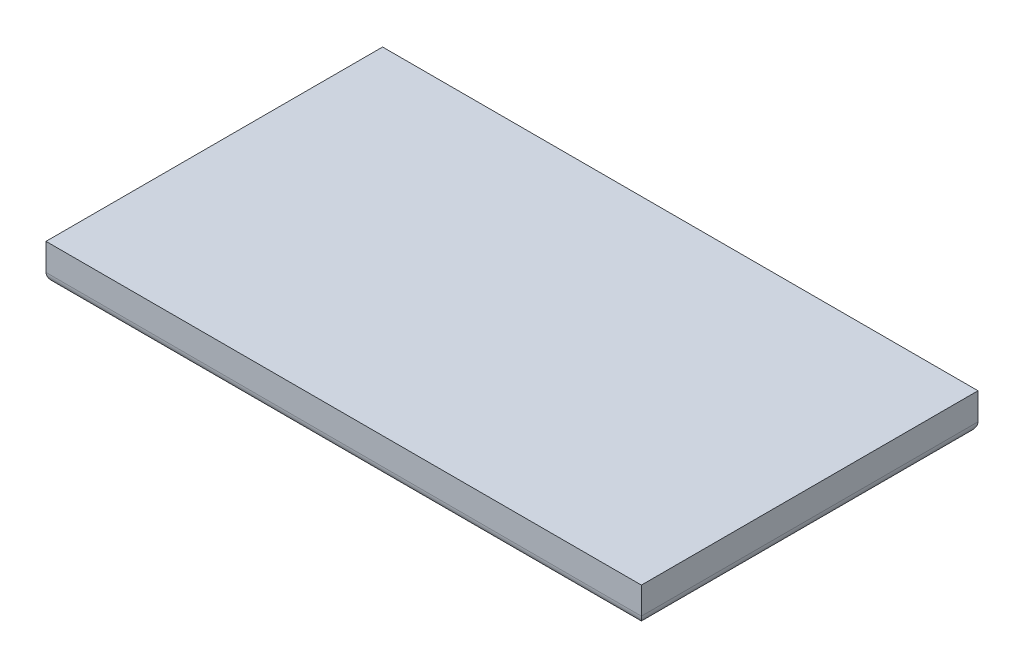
from build123d import *

# Parameters (mm, degrees)
SKETCH1_W           = 17.688
SKETCH1_H           = 10
BOSS_EXTRUDE1_DEPTH = 1.1
FILLET1_R           = 0.3


with BuildPart() as part:
    # Sketch1 → Boss-Extrude1 (new body)
    with BuildSketch(Plane(origin=(0, 0, 0), x_dir=(1, 0, 0), z_dir=(0, 1, 0))):
        Rectangle(SKETCH1_W, SKETCH1_H)
    extrude(amount=BOSS_EXTRUDE1_DEPTH)

    # Fillet1
    fillet1_edges = [part.edges().sort_by_distance(p)[0] for p in [
        (0, 0, 5),
        (-8.844, 0, 0),
        (0, 0, -5),
        (8.844, 0, 0),
    ]]
    fillet(fillet1_edges, radius=FILLET1_R)


solid = part.part
